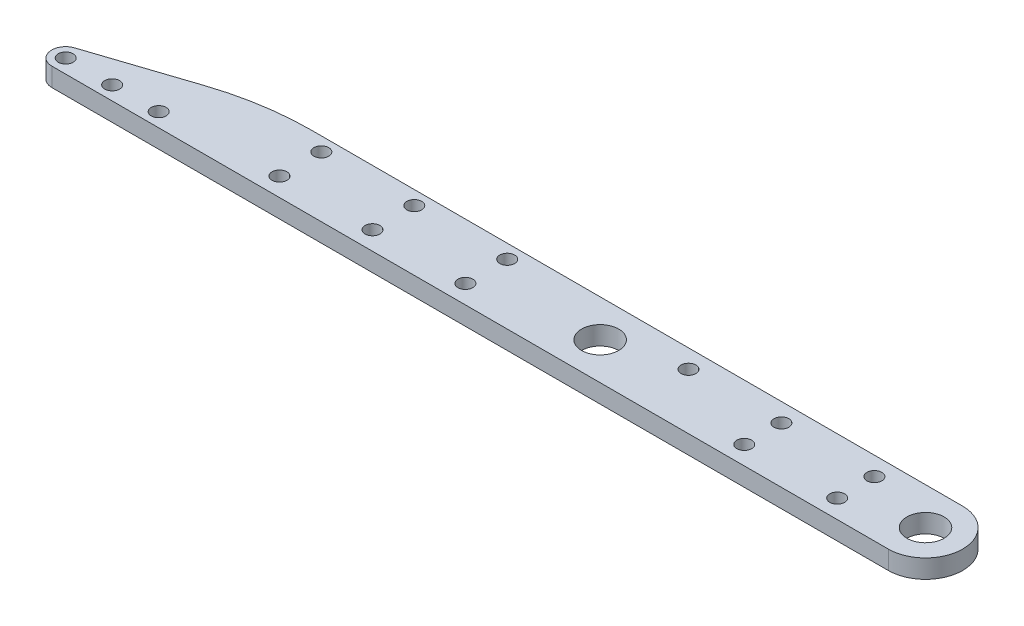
from build123d import *

# Parameters (mm, degrees)
SKETCH_1_R          = 4
SKETCH_1_R_2        = 1.6
EXTRUDE_1_DEPTH     = 4
SKETCH_2_R          = 1.6
CUT_EXTRUDE_1_DEPTH = 184.218448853


with BuildPart() as part:
    # Sketch 1 → Extrude 1 (new body)
    with BuildSketch(Plane(origin=(0, 0, 0), x_dir=(1, 0, 0), z_dir=(0, 1, 0))):
        with BuildLine():
            Line((0, -8), (-180, -8))
            ThreePointArc((-180, -8), (-182.961794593, -5.477255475), (-180.942355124, -2.151848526))
            Line((-180.942355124, -2.151848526), (-160, 4.777254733))
            ThreePointArc((-160, 4.777254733), (-150.128994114, 7.189150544), (-140, 8))
            Line((-140, 8), (0, 8))
            ThreePointArc((0, 8), (8, 0), (0, -8))
        make_face()
        with Locations(Location((0, 0, 0), (0, 0, 270))):
            Circle(SKETCH_1_R, mode=Mode.SUBTRACT)
        with Locations(Location((-70, 0, 0), (0, 0, 270))):
            Circle(SKETCH_1_R, mode=Mode.SUBTRACT)
        with Locations(Location((-180, -5, 0), (0, 0, 270))):
            Circle(SKETCH_1_R_2, mode=Mode.SUBTRACT)
        with Locations(Location((-170, -5, 0), (0, 0, 270))):
            Circle(SKETCH_1_R_2, mode=Mode.SUBTRACT)
        with Locations(Location((-160, -5, 0), (0, 0, 270))):
            Circle(SKETCH_1_R_2, mode=Mode.SUBTRACT)
    extrude(amount=EXTRUDE_1_DEPTH)

    # Sketch 2 → Cut-Extrude 1 (cut, through all)
    with BuildSketch(Plane(origin=(0, 4, 0), x_dir=(1, 0, 0), z_dir=(0, 1, 0))):
        with Locations(Location((-135, 5, 0), (0, 0, 270))):
            Circle(SKETCH_2_R)
        with Locations(Location((-115, 5, 0), (0, 0, 270))):
            Circle(SKETCH_2_R)
        with Locations(Location((-95, 5, 0), (0, 0, 270))):
            Circle(SKETCH_2_R)
        with Locations(Location((-135, -4, 0), (0, 0, 270))):
            Circle(SKETCH_2_R)
        with Locations(Location((-115, -4, 0), (0, 0, 270))):
            Circle(SKETCH_2_R)
        with Locations(Location((-95, -4, 0), (0, 0, 270))):
            Circle(SKETCH_2_R)
        with Locations(Location((-35, -4, 0), (0, 0, 270))):
            Circle(SKETCH_2_R)
        with Locations(Location((-15, -4, 0), (0, 0, 270))):
            Circle(SKETCH_2_R)
        with Locations(Location((-55, 4, 0), (0, 0, 270))):
            Circle(SKETCH_2_R)
        with Locations(Location((-35, 4, 0), (0, 0, 270))):
            Circle(SKETCH_2_R)
        with Locations(Location((-15, 4, 0), (0, 0, 270))):
            Circle(SKETCH_2_R)
    extrude(amount=-CUT_EXTRUDE_1_DEPTH, mode=Mode.SUBTRACT)


solid = part.part
